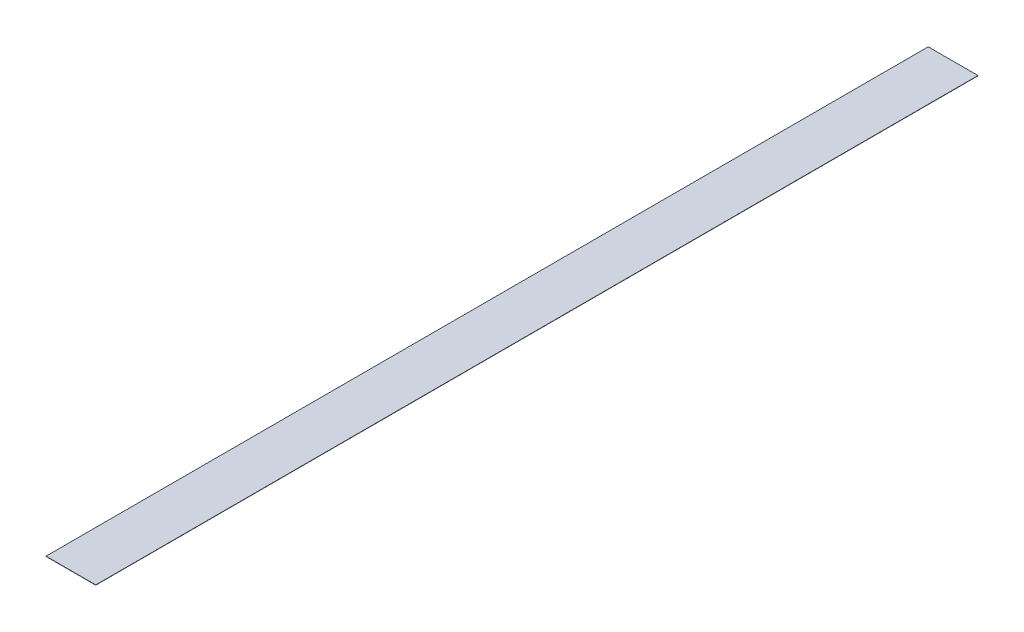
from build123d import *

# Parameters (mm, degrees)
SKETCH1_W           = 47.625
SKETCH1_H           = 844.55
BOSS_EXTRUDE1_DEPTH = 0.254


with BuildPart() as part:
    # Sketch1 → Boss-Extrude1 (new body)
    with BuildSketch(Plane(origin=(0, 0, 0), x_dir=(1, 0, 0), z_dir=(0, 1, 0))):
        Rectangle(SKETCH1_W, SKETCH1_H)
    extrude(amount=BOSS_EXTRUDE1_DEPTH)


solid = part.part
